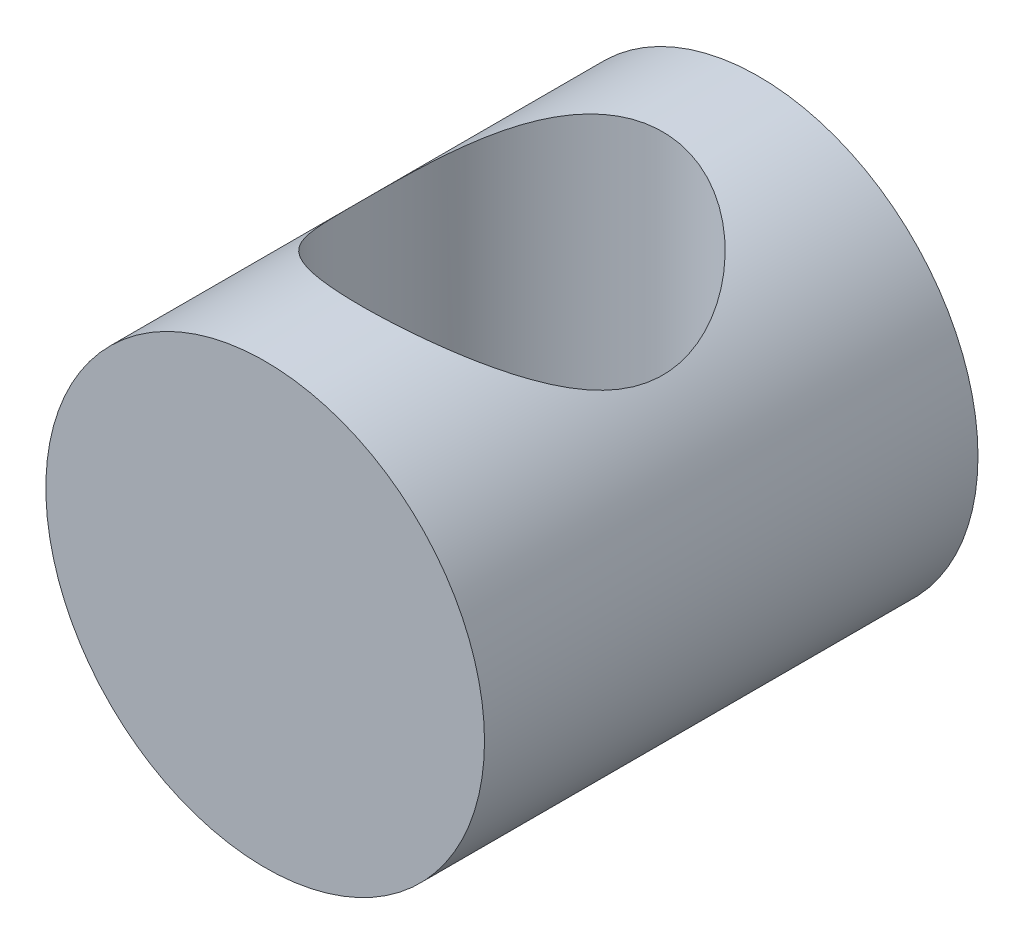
ISO-10303-21;
HEADER;
FILE_DESCRIPTION(('STEP AP214'),'2;1');
FILE_NAME('part.step','',(''),(''),'','','');
FILE_SCHEMA(('AUTOMOTIVE_DESIGN { 1 0 10303 214 1 1 1 1 }'));
ENDSEC;
DATA;
#1=APPLICATION_CONTEXT('core data for automotive mechanical design processes');
#2=APPLICATION_PROTOCOL_DEFINITION('international standard','automotive_design',2000,#1);
#3=PRODUCT_CONTEXT('',#1,'mechanical');
#4=PRODUCT('Part','Part','',(#3));
#5=PRODUCT_RELATED_PRODUCT_CATEGORY('part','',(#4));
#6=PRODUCT_DEFINITION_FORMATION('','',#4);
#7=PRODUCT_DEFINITION_CONTEXT('part definition',#1,'design');
#8=PRODUCT_DEFINITION('design','',#6,#7);
#9=PRODUCT_DEFINITION_SHAPE('','',#8);
#10=(LENGTH_UNIT() NAMED_UNIT(*) SI_UNIT(.MILLI.,.METRE.));
#11=(NAMED_UNIT(*) PLANE_ANGLE_UNIT() SI_UNIT($,.RADIAN.));
#12=(NAMED_UNIT(*) SI_UNIT($,.STERADIAN.) SOLID_ANGLE_UNIT());
#13=UNCERTAINTY_MEASURE_WITH_UNIT(LENGTH_MEASURE(1.E-05),#10,'distance_accuracy_value','');
#14=(GEOMETRIC_REPRESENTATION_CONTEXT(3) GLOBAL_UNCERTAINTY_ASSIGNED_CONTEXT((#13)) GLOBAL_UNIT_ASSIGNED_CONTEXT((#10,
#11,#12)) REPRESENTATION_CONTEXT('',''));
#15=CARTESIAN_POINT('',(0.,0.,0.));
#16=DIRECTION('',(0.,0.,1.));
#17=DIRECTION('',(1.,0.,0.));
#18=AXIS2_PLACEMENT_3D('',#15,#16,#17);
#19=CARTESIAN_POINT('',(0.,0.,18.));
#20=DIRECTION('',(0.,0.,-1.));
#21=DIRECTION('',(-1.,0.,0.));
#22=AXIS2_PLACEMENT_3D('',#19,#20,#21);
#23=CYLINDRICAL_SURFACE('',#22,8.);
#24=CARTESIAN_POINT('',(0.,-8.,14.5));
#25=CARTESIAN_POINT('',(0.137266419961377,-7.99999987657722,14.4999998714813));
#26=CARTESIAN_POINT('',(0.274534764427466,-7.99645958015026,14.4948541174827));
#27=CARTESIAN_POINT('',(0.547943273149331,-7.98238674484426,14.4743541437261));
#28=CARTESIAN_POINT('',(0.684083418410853,-7.97185408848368,14.4589997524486));
#29=CARTESIAN_POINT('',(0.954192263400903,-7.94405156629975,14.4183185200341));
#30=CARTESIAN_POINT('',(1.08816047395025,-7.92678020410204,14.3929894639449));
#31=CARTESIAN_POINT('',(1.35297984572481,-7.88589932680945,14.3327195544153));
#32=CARTESIAN_POINT('',(1.48382964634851,-7.86228709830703,14.2977745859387));
#33=CARTESIAN_POINT('',(1.74083213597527,-7.80939299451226,14.2189528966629));
#34=CARTESIAN_POINT('',(1.86700623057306,-7.7801421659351,14.1751250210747));
#35=CARTESIAN_POINT('',(2.11473737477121,-7.71649352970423,14.0789335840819));
#36=CARTESIAN_POINT('',(2.23629259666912,-7.68209371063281,14.0265666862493));
#37=CARTESIAN_POINT('',(2.59307020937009,-7.57217048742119,13.8574841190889));
#38=CARTESIAN_POINT('',(2.82063002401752,-7.48987513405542,13.7287162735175));
#39=CARTESIAN_POINT('',(3.27066804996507,-7.30527689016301,13.4307937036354));
#40=CARTESIAN_POINT('',(3.49097725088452,-7.201855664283,13.2590981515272));
#41=CARTESIAN_POINT('',(3.90178342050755,-6.98782684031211,12.8862741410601));
#42=CARTESIAN_POINT('',(4.09223553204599,-6.87720877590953,12.685102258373));
#43=CARTESIAN_POINT('',(4.36862185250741,-6.70296528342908,12.3453353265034));
#44=CARTESIAN_POINT('',(4.46513198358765,-6.63888776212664,12.2154145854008));
#45=CARTESIAN_POINT('',(4.64682921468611,-6.51300043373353,11.9467411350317));
#46=CARTESIAN_POINT('',(4.73201351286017,-6.45119119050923,11.8079862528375));
#47=CARTESIAN_POINT('',(4.89030116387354,-6.33204236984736,11.5222164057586));
#48=CARTESIAN_POINT('',(4.96342358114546,-6.27469581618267,11.3752149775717));
#49=CARTESIAN_POINT('',(5.09696884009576,-6.16670701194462,11.0732121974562));
#50=CARTESIAN_POINT('',(5.15739158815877,-6.11606481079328,10.9182107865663));
#51=CARTESIAN_POINT('',(5.28562320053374,-6.00599161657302,10.5383281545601));
#52=CARTESIAN_POINT('',(5.34703685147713,-5.95090176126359,10.3098796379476));
#53=CARTESIAN_POINT('',(5.41693530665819,-5.88708591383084,9.95969894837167));
#54=CARTESIAN_POINT('',(5.43652795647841,-5.86895370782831,9.84176605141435));
#55=CARTESIAN_POINT('',(5.46804253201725,-5.8396048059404,9.6040356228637));
#56=CARTESIAN_POINT('',(5.4799673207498,-5.82838552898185,9.48423880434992));
#57=CARTESIAN_POINT('',(5.49596558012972,-5.81330236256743,9.24301453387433));
#58=CARTESIAN_POINT('',(5.49999675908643,-5.80947809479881,9.12158178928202));
#59=CARTESIAN_POINT('',(5.50000323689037,-5.80947194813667,8.87871571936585));
#60=CARTESIAN_POINT('',(5.49597854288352,-5.81329006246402,8.75728239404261));
#61=CARTESIAN_POINT('',(5.47994768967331,-5.82840411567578,8.5153639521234));
#62=CARTESIAN_POINT('',(5.46793819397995,-5.83970318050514,8.39487925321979));
#63=CARTESIAN_POINT('',(5.43616344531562,-5.86929197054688,8.15578729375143));
#64=CARTESIAN_POINT('',(5.41639493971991,-5.88758462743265,8.03718084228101));
#65=CARTESIAN_POINT('',(5.34864197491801,-5.94942574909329,7.69895690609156));
#66=CARTESIAN_POINT('',(5.29115689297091,-6.00101168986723,7.48263542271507));
#67=CARTESIAN_POINT('',(5.15227529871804,-6.12065172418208,7.06269754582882));
#68=CARTESIAN_POINT('',(5.07086005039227,-6.18871871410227,6.85909125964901));
#69=CARTESIAN_POINT('',(4.90919386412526,-6.31725428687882,6.514743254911));
#70=CARTESIAN_POINT('',(4.83362805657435,-6.37544321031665,6.37090126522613));
#71=CARTESIAN_POINT('',(4.67090265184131,-6.49560554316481,6.09159965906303));
#72=CARTESIAN_POINT('',(4.58374271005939,-6.557579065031,5.95614029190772));
#73=CARTESIAN_POINT('',(4.39819265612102,-6.68344948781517,5.69367568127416));
#74=CARTESIAN_POINT('',(4.29978166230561,-6.74734979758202,5.56668687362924));
#75=CARTESIAN_POINT('',(4.09227177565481,-6.87518444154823,5.32181264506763));
#76=CARTESIAN_POINT('',(3.98317417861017,-6.93911877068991,5.20392612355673));
#77=CARTESIAN_POINT('',(3.75347594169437,-7.06603194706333,4.97659515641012));
#78=CARTESIAN_POINT('',(3.63277138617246,-7.12899489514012,4.8672466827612));
#79=CARTESIAN_POINT('',(3.38116315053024,-7.25171170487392,4.6589866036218));
#80=CARTESIAN_POINT('',(3.25026070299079,-7.3114659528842,4.56007374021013));
#81=CARTESIAN_POINT('',(2.97892919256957,-7.4261455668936,4.37365947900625));
#82=CARTESIAN_POINT('',(2.83851659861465,-7.48107892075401,4.28613908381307));
#83=CARTESIAN_POINT('',(2.54862267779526,-7.584734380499,4.12330668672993));
#84=CARTESIAN_POINT('',(2.3991440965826,-7.63345835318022,4.04799101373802));
#85=CARTESIAN_POINT('',(2.12610532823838,-7.71331232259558,3.92586785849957));
#86=CARTESIAN_POINT('',(2.00414979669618,-7.74594770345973,3.87644239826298));
#87=CARTESIAN_POINT('',(1.75587264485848,-7.80597279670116,3.78613861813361));
#88=CARTESIAN_POINT('',(1.62955197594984,-7.83336364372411,3.74525844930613));
#89=CARTESIAN_POINT('',(1.37329013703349,-7.88232721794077,3.67254238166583));
#90=CARTESIAN_POINT('',(1.24335068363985,-7.90390265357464,3.64070227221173));
#91=CARTESIAN_POINT('',(0.980628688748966,-7.94077833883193,3.58646542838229));
#92=CARTESIAN_POINT('',(0.847846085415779,-7.9560784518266,3.56406889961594));
#93=CARTESIAN_POINT('',(0.579909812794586,-7.98009151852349,3.52898316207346));
#94=CARTESIAN_POINT('',(0.444749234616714,-7.98878011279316,3.51632984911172));
#95=CARTESIAN_POINT('',(0.173593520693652,-7.99926705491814,3.50106334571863));
#96=CARTESIAN_POINT('',(0.0375983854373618,-8.0010654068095,3.49845014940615));
#97=CARTESIAN_POINT('',(-0.23412842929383,-7.99772754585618,3.50330562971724));
#98=CARTESIAN_POINT('',(-0.369860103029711,-7.99259118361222,3.51077452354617));
#99=CARTESIAN_POINT('',(-0.639966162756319,-7.97550985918,3.5356757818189));
#100=CARTESIAN_POINT('',(-0.774340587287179,-7.96356509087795,3.55310786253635));
#101=CARTESIAN_POINT('',(-1.03300361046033,-7.93403118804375,3.59638208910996));
#102=CARTESIAN_POINT('',(-1.15742582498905,-7.91680874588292,3.62167909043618));
#103=CARTESIAN_POINT('',(-1.40342019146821,-7.87692633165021,3.68056097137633));
#104=CARTESIAN_POINT('',(-1.52499135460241,-7.85426450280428,3.71414868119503));
#105=CARTESIAN_POINT('',(-1.88431514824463,-7.77875915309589,3.82677631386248));
#106=CARTESIAN_POINT('',(-2.11688002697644,-7.71837170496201,3.91771526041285));
#107=CARTESIAN_POINT('',(-2.58089638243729,-7.57643923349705,4.13586426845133));
#108=CARTESIAN_POINT('',(-2.81087757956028,-7.4936212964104,4.26533144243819));
#109=CARTESIAN_POINT('',(-3.24680165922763,-7.31531257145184,4.55291914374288));
#110=CARTESIAN_POINT('',(-3.4527272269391,-7.2198127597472,4.71106010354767));
#111=CARTESIAN_POINT('',(-3.87132112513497,-7.00550458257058,5.08161103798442));
#112=CARTESIAN_POINT('',(-4.07924157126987,-6.8854854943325,5.29867588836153));
#113=CARTESIAN_POINT('',(-4.45767290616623,-6.64673868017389,5.76438738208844));
#114=CARTESIAN_POINT('',(-4.62816238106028,-6.52801173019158,6.01305197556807));
#115=CARTESIAN_POINT('',(-4.84380627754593,-6.36744101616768,6.39133987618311));
#116=CARTESIAN_POINT('',(-4.90554891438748,-6.31988980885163,6.5093203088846));
#117=CARTESIAN_POINT('',(-5.02083091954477,-6.22869510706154,6.75074473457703));
#118=CARTESIAN_POINT('',(-5.07436945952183,-6.18505200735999,6.87418927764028));
#119=CARTESIAN_POINT('',(-5.17266294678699,-6.10308564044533,7.12601986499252));
#120=CARTESIAN_POINT('',(-5.2174307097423,-6.06475463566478,7.25439836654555));
#121=CARTESIAN_POINT('',(-5.29769958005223,-5.99476587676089,7.51573553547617));
#122=CARTESIAN_POINT('',(-5.33320654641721,-5.9631039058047,7.64869124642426));
#123=CARTESIAN_POINT('',(-5.38894978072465,-5.9127294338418,7.89448821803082));
#124=CARTESIAN_POINT('',(-5.41077870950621,-5.89271543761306,8.00670265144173));
#125=CARTESIAN_POINT('',(-5.447482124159,-5.85880240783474,8.23313494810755));
#126=CARTESIAN_POINT('',(-5.46235996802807,-5.84490042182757,8.34735181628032));
#127=CARTESIAN_POINT('',(-5.48492486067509,-5.82373081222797,8.57702980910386));
#128=CARTESIAN_POINT('',(-5.49261692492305,-5.81645856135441,8.69249000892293));
#129=CARTESIAN_POINT('',(-5.5006920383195,-5.80882242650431,8.92389815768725));
#130=CARTESIAN_POINT('',(-5.50107496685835,-5.80845865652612,9.03984611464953));
#131=CARTESIAN_POINT('',(-5.49452269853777,-5.8146576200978,9.27133226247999));
#132=CARTESIAN_POINT('',(-5.48758865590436,-5.8212192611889,9.38687051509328));
#133=CARTESIAN_POINT('',(-5.46653306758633,-5.84099396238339,9.61673163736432));
#134=CARTESIAN_POINT('',(-5.45240906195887,-5.85420929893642,9.73105407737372));
#135=CARTESIAN_POINT('',(-5.39954564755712,-5.90316060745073,10.071214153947));
#136=CARTESIAN_POINT('',(-5.35031745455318,-5.94819906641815,10.2941604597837));
#137=CARTESIAN_POINT('',(-5.20736893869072,-6.0741055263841,10.7945509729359));
#138=CARTESIAN_POINT('',(-5.10462333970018,-6.16173174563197,11.0676794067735));
#139=CARTESIAN_POINT('',(-4.92207151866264,-6.30708364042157,11.4584512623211));
#140=CARTESIAN_POINT('',(-4.85639062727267,-6.35791911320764,11.5856896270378));
#141=CARTESIAN_POINT('',(-4.71597898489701,-6.46275715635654,11.8336959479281));
#142=CARTESIAN_POINT('',(-4.64124882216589,-6.51675952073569,11.9544643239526));
#143=CARTESIAN_POINT('',(-4.40061245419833,-6.68379581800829,12.3118378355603));
#144=CARTESIAN_POINT('',(-4.22083124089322,-6.79971419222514,12.5380376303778));
#145=CARTESIAN_POINT('',(-3.92596286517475,-6.97135955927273,12.8545596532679));
#146=CARTESIAN_POINT('',(-3.82342021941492,-7.02822867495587,12.9563128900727));
#147=CARTESIAN_POINT('',(-3.61004986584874,-7.14017005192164,13.1519250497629));
#148=CARTESIAN_POINT('',(-3.49922082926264,-7.19524202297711,13.2457827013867));
#149=CARTESIAN_POINT('',(-3.25261212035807,-7.31038114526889,13.4382955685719));
#150=CARTESIAN_POINT('',(-3.11556524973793,-7.36998432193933,13.5356111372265));
#151=CARTESIAN_POINT('',(-2.83155594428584,-7.48369365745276,13.718131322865));
#152=CARTESIAN_POINT('',(-2.68459805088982,-7.53780230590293,13.8033414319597));
#153=CARTESIAN_POINT('',(-2.38165111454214,-7.63892723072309,13.960526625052));
#154=CARTESIAN_POINT('',(-2.22567242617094,-7.6859514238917,14.0325165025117));
#155=CARTESIAN_POINT('',(-1.90565844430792,-7.77147738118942,14.1621931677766));
#156=CARTESIAN_POINT('',(-1.74162640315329,-7.80998255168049,14.2198856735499));
#157=CARTESIAN_POINT('',(-1.4482825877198,-7.86886427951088,14.3075226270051));
#158=CARTESIAN_POINT('',(-1.32038319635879,-7.89136980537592,14.3408013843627));
#159=CARTESIAN_POINT('',(-1.06164857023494,-7.93032178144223,14.3981894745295));
#160=CARTESIAN_POINT('',(-0.930813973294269,-7.94676953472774,14.4223007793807));
#161=CARTESIAN_POINT('',(-0.667175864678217,-7.97323135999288,14.4610088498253));
#162=CARTESIAN_POINT('',(-0.534373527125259,-7.98324912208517,14.4756110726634));
#163=CARTESIAN_POINT('',(-0.267714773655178,-7.99663367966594,14.4951069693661));
#164=CARTESIAN_POINT('',(-0.133858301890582,-8.00000012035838,14.5000001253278));
#165=CARTESIAN_POINT('',(0.,-8.,14.5));
#166=B_SPLINE_CURVE_WITH_KNOTS('',3,(#24,#25,#26,#27,#28,#29,#30,#31,#32,#33,#34,#35,#36,#37,
#38,#39,#40,#41,#42,#43,#44,#45,#46,#47,#48,#49,#50,#51,#52,#53,#54,#55,#56,#57,#58,#59,#60,#61,
#62,#63,#64,#65,#66,#67,#68,#69,#70,#71,#72,#73,#74,#75,#76,#77,#78,#79,#80,#81,#82,#83,#84,#85,
#86,#87,#88,#89,#90,#91,#92,#93,#94,#95,#96,#97,#98,#99,#100,#101,#102,#103,#104,#105,#106,#107,
#108,#109,#110,#111,#112,#113,#114,#115,#116,#117,#118,#119,#120,#121,#122,#123,#124,#125,#126,
#127,#128,#129,#130,#131,#132,#133,#134,#135,#136,#137,#138,#139,#140,#141,#142,#143,#144,#145,
#146,#147,#148,#149,#150,#151,#152,#153,#154,#155,#156,#157,#158,#159,#160,#161,#162,#163,#164,
#165),.UNSPECIFIED.,.T.,.F.,(4,2,2,2,2,2,2,2,2,2,2,2,2,2,2,2,2,2,2,2,2,2,2,2,2,2,2,2,2,2,2,2,2,
2,2,2,2,2,2,2,2,2,2,2,2,2,2,2,2,2,2,2,2,2,2,2,2,2,2,2,2,2,2,2,2,2,2,2,2,2,4),(0.,
0.411661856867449,0.823330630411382,1.23509086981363,1.64702759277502,2.05675779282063,
2.46664847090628,3.2857146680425,4.17612227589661,5.06785506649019,5.58954551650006,
6.11136478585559,6.6323512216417,7.15334149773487,7.87863512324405,8.24101211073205,
8.60325371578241,8.96743085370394,9.33160766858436,9.69593675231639,10.060418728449,
10.7467806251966,11.4336813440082,11.9508182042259,12.4679704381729,12.986098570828,
13.5041639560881,14.0273986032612,14.5505701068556,15.072857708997,15.5949879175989,
16.0013132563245,16.4075505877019,16.8135983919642,17.2196550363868,17.6272006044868,
18.034745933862,18.442300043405,18.8498425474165,19.2337976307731,19.6178839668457,
20.3854447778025,21.2122255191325,22.0395977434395,23.0068744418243,23.9747030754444,
24.3985827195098,24.8225051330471,25.2458034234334,25.6688332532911,26.0166473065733,
26.3642931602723,26.7116961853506,27.0591049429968,27.4064589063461,27.753931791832,
28.4491268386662,29.3580346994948,29.8135308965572,30.268997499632,31.1989975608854,
31.6644323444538,32.1299419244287,32.6642217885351,33.1982584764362,33.7316938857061,
34.2649156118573,34.6666522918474,35.0683025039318,35.4697220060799,35.8711629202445),.UNSPECIFIED.);
#167=CARTESIAN_POINT('',(0.,-8.,14.5));
#168=VERTEX_POINT('',#167);
#169=EDGE_CURVE('E33',#168,#168,#166,.T.);
#170=ORIENTED_EDGE('',*,*,#169,.T.);
#171=EDGE_LOOP('',(#170));
#172=FACE_BOUND('',#171,.T.);
#173=CARTESIAN_POINT('',(0.,8.,14.5));
#174=CARTESIAN_POINT('',(-0.137266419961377,7.99999987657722,14.4999998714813));
#175=CARTESIAN_POINT('',(-0.274534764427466,7.99645958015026,14.4948541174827));
#176=CARTESIAN_POINT('',(-0.547943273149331,7.98238674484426,14.4743541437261));
#177=CARTESIAN_POINT('',(-0.684083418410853,7.97185408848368,14.4589997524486));
#178=CARTESIAN_POINT('',(-0.954192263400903,7.94405156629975,14.4183185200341));
#179=CARTESIAN_POINT('',(-1.08816047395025,7.92678020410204,14.3929894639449));
#180=CARTESIAN_POINT('',(-1.35297984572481,7.88589932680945,14.3327195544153));
#181=CARTESIAN_POINT('',(-1.48382964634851,7.86228709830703,14.2977745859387));
#182=CARTESIAN_POINT('',(-1.74083213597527,7.80939299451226,14.2189528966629));
#183=CARTESIAN_POINT('',(-1.86700623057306,7.7801421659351,14.1751250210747));
#184=CARTESIAN_POINT('',(-2.11473737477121,7.71649352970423,14.0789335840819));
#185=CARTESIAN_POINT('',(-2.23629259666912,7.68209371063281,14.0265666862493));
#186=CARTESIAN_POINT('',(-2.59307020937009,7.57217048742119,13.8574841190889));
#187=CARTESIAN_POINT('',(-2.82063002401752,7.48987513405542,13.7287162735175));
#188=CARTESIAN_POINT('',(-3.27066804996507,7.30527689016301,13.4307937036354));
#189=CARTESIAN_POINT('',(-3.49097725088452,7.201855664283,13.2590981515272));
#190=CARTESIAN_POINT('',(-3.90178342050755,6.98782684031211,12.8862741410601));
#191=CARTESIAN_POINT('',(-4.09223553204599,6.87720877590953,12.685102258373));
#192=CARTESIAN_POINT('',(-4.36862185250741,6.70296528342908,12.3453353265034));
#193=CARTESIAN_POINT('',(-4.46513198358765,6.63888776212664,12.2154145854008));
#194=CARTESIAN_POINT('',(-4.64682921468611,6.51300043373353,11.9467411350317));
#195=CARTESIAN_POINT('',(-4.73201351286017,6.45119119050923,11.8079862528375));
#196=CARTESIAN_POINT('',(-4.89030116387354,6.33204236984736,11.5222164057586));
#197=CARTESIAN_POINT('',(-4.96342358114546,6.27469581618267,11.3752149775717));
#198=CARTESIAN_POINT('',(-5.09696884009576,6.16670701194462,11.0732121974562));
#199=CARTESIAN_POINT('',(-5.15739158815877,6.11606481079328,10.9182107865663));
#200=CARTESIAN_POINT('',(-5.28562320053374,6.00599161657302,10.5383281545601));
#201=CARTESIAN_POINT('',(-5.34703685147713,5.95090176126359,10.3098796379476));
#202=CARTESIAN_POINT('',(-5.41693530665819,5.88708591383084,9.95969894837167));
#203=CARTESIAN_POINT('',(-5.43652795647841,5.86895370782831,9.84176605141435));
#204=CARTESIAN_POINT('',(-5.46804253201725,5.8396048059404,9.6040356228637));
#205=CARTESIAN_POINT('',(-5.4799673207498,5.82838552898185,9.48423880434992));
#206=CARTESIAN_POINT('',(-5.49596558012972,5.81330236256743,9.24301453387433));
#207=CARTESIAN_POINT('',(-5.49999675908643,5.80947809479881,9.12158178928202));
#208=CARTESIAN_POINT('',(-5.50000323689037,5.80947194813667,8.87871571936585));
#209=CARTESIAN_POINT('',(-5.49597854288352,5.81329006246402,8.75728239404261));
#210=CARTESIAN_POINT('',(-5.47994768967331,5.82840411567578,8.5153639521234));
#211=CARTESIAN_POINT('',(-5.46793819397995,5.83970318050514,8.39487925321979));
#212=CARTESIAN_POINT('',(-5.43616344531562,5.86929197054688,8.15578729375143));
#213=CARTESIAN_POINT('',(-5.41639493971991,5.88758462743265,8.03718084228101));
#214=CARTESIAN_POINT('',(-5.34864197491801,5.94942574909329,7.69895690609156));
#215=CARTESIAN_POINT('',(-5.29115689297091,6.00101168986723,7.48263542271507));
#216=CARTESIAN_POINT('',(-5.15227529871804,6.12065172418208,7.06269754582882));
#217=CARTESIAN_POINT('',(-5.07086005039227,6.18871871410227,6.85909125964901));
#218=CARTESIAN_POINT('',(-4.90919386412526,6.31725428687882,6.514743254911));
#219=CARTESIAN_POINT('',(-4.83362805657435,6.37544321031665,6.37090126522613));
#220=CARTESIAN_POINT('',(-4.67090265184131,6.49560554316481,6.09159965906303));
#221=CARTESIAN_POINT('',(-4.58374271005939,6.557579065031,5.95614029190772));
#222=CARTESIAN_POINT('',(-4.39819265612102,6.68344948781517,5.69367568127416));
#223=CARTESIAN_POINT('',(-4.29978166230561,6.74734979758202,5.56668687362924));
#224=CARTESIAN_POINT('',(-4.09227177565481,6.87518444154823,5.32181264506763));
#225=CARTESIAN_POINT('',(-3.98317417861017,6.93911877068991,5.20392612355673));
#226=CARTESIAN_POINT('',(-3.75347594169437,7.06603194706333,4.97659515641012));
#227=CARTESIAN_POINT('',(-3.63277138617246,7.12899489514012,4.8672466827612));
#228=CARTESIAN_POINT('',(-3.38116315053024,7.25171170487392,4.6589866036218));
#229=CARTESIAN_POINT('',(-3.25026070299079,7.3114659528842,4.56007374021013));
#230=CARTESIAN_POINT('',(-2.97892919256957,7.4261455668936,4.37365947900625));
#231=CARTESIAN_POINT('',(-2.83851659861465,7.48107892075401,4.28613908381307));
#232=CARTESIAN_POINT('',(-2.54862267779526,7.584734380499,4.12330668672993));
#233=CARTESIAN_POINT('',(-2.3991440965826,7.63345835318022,4.04799101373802));
#234=CARTESIAN_POINT('',(-2.12610532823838,7.71331232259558,3.92586785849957));
#235=CARTESIAN_POINT('',(-2.00414979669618,7.74594770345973,3.87644239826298));
#236=CARTESIAN_POINT('',(-1.75587264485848,7.80597279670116,3.78613861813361));
#237=CARTESIAN_POINT('',(-1.62955197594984,7.83336364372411,3.74525844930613));
#238=CARTESIAN_POINT('',(-1.37329013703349,7.88232721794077,3.67254238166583));
#239=CARTESIAN_POINT('',(-1.24335068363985,7.90390265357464,3.64070227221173));
#240=CARTESIAN_POINT('',(-0.980628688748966,7.94077833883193,3.58646542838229));
#241=CARTESIAN_POINT('',(-0.847846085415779,7.9560784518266,3.56406889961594));
#242=CARTESIAN_POINT('',(-0.579909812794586,7.98009151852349,3.52898316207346));
#243=CARTESIAN_POINT('',(-0.444749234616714,7.98878011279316,3.51632984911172));
#244=CARTESIAN_POINT('',(-0.173593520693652,7.99926705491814,3.50106334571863));
#245=CARTESIAN_POINT('',(-0.0375983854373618,8.0010654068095,3.49845014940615));
#246=CARTESIAN_POINT('',(0.23412842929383,7.99772754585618,3.50330562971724));
#247=CARTESIAN_POINT('',(0.369860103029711,7.99259118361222,3.51077452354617));
#248=CARTESIAN_POINT('',(0.639966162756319,7.97550985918,3.5356757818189));
#249=CARTESIAN_POINT('',(0.774340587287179,7.96356509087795,3.55310786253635));
#250=CARTESIAN_POINT('',(1.03300361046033,7.93403118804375,3.59638208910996));
#251=CARTESIAN_POINT('',(1.15742582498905,7.91680874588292,3.62167909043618));
#252=CARTESIAN_POINT('',(1.40342019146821,7.87692633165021,3.68056097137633));
#253=CARTESIAN_POINT('',(1.52499135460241,7.85426450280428,3.71414868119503));
#254=CARTESIAN_POINT('',(1.88431514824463,7.77875915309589,3.82677631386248));
#255=CARTESIAN_POINT('',(2.11688002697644,7.71837170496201,3.91771526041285));
#256=CARTESIAN_POINT('',(2.58089638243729,7.57643923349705,4.13586426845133));
#257=CARTESIAN_POINT('',(2.81087757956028,7.4936212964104,4.26533144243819));
#258=CARTESIAN_POINT('',(3.24680165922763,7.31531257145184,4.55291914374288));
#259=CARTESIAN_POINT('',(3.4527272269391,7.2198127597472,4.71106010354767));
#260=CARTESIAN_POINT('',(3.87132112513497,7.00550458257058,5.08161103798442));
#261=CARTESIAN_POINT('',(4.07924157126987,6.8854854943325,5.29867588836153));
#262=CARTESIAN_POINT('',(4.45767290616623,6.64673868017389,5.76438738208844));
#263=CARTESIAN_POINT('',(4.62816238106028,6.52801173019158,6.01305197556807));
#264=CARTESIAN_POINT('',(4.84380627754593,6.36744101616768,6.39133987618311));
#265=CARTESIAN_POINT('',(4.90554891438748,6.31988980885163,6.5093203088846));
#266=CARTESIAN_POINT('',(5.02083091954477,6.22869510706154,6.75074473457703));
#267=CARTESIAN_POINT('',(5.07436945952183,6.18505200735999,6.87418927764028));
#268=CARTESIAN_POINT('',(5.17266294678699,6.10308564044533,7.12601986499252));
#269=CARTESIAN_POINT('',(5.2174307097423,6.06475463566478,7.25439836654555));
#270=CARTESIAN_POINT('',(5.29769958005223,5.99476587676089,7.51573553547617));
#271=CARTESIAN_POINT('',(5.33320654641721,5.9631039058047,7.64869124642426));
#272=CARTESIAN_POINT('',(5.38894978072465,5.9127294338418,7.89448821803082));
#273=CARTESIAN_POINT('',(5.41077870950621,5.89271543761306,8.00670265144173));
#274=CARTESIAN_POINT('',(5.447482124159,5.85880240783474,8.23313494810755));
#275=CARTESIAN_POINT('',(5.46235996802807,5.84490042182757,8.34735181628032));
#276=CARTESIAN_POINT('',(5.48492486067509,5.82373081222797,8.57702980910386));
#277=CARTESIAN_POINT('',(5.49261692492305,5.81645856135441,8.69249000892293));
#278=CARTESIAN_POINT('',(5.5006920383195,5.80882242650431,8.92389815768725));
#279=CARTESIAN_POINT('',(5.50107496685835,5.80845865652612,9.03984611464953));
#280=CARTESIAN_POINT('',(5.49452269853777,5.8146576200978,9.27133226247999));
#281=CARTESIAN_POINT('',(5.48758865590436,5.8212192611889,9.38687051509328));
#282=CARTESIAN_POINT('',(5.46653306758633,5.84099396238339,9.61673163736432));
#283=CARTESIAN_POINT('',(5.45240906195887,5.85420929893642,9.73105407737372));
#284=CARTESIAN_POINT('',(5.39954564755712,5.90316060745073,10.071214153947));
#285=CARTESIAN_POINT('',(5.35031745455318,5.94819906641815,10.2941604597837));
#286=CARTESIAN_POINT('',(5.20736893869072,6.0741055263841,10.7945509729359));
#287=CARTESIAN_POINT('',(5.10462333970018,6.16173174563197,11.0676794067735));
#288=CARTESIAN_POINT('',(4.92207151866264,6.30708364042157,11.4584512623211));
#289=CARTESIAN_POINT('',(4.85639062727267,6.35791911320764,11.5856896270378));
#290=CARTESIAN_POINT('',(4.71597898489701,6.46275715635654,11.8336959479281));
#291=CARTESIAN_POINT('',(4.64124882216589,6.51675952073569,11.9544643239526));
#292=CARTESIAN_POINT('',(4.40061245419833,6.68379581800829,12.3118378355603));
#293=CARTESIAN_POINT('',(4.22083124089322,6.79971419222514,12.5380376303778));
#294=CARTESIAN_POINT('',(3.92596286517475,6.97135955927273,12.8545596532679));
#295=CARTESIAN_POINT('',(3.82342021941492,7.02822867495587,12.9563128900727));
#296=CARTESIAN_POINT('',(3.61004986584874,7.14017005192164,13.1519250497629));
#297=CARTESIAN_POINT('',(3.49922082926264,7.19524202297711,13.2457827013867));
#298=CARTESIAN_POINT('',(3.25261212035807,7.31038114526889,13.4382955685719));
#299=CARTESIAN_POINT('',(3.11556524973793,7.36998432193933,13.5356111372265));
#300=CARTESIAN_POINT('',(2.83155594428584,7.48369365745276,13.718131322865));
#301=CARTESIAN_POINT('',(2.68459805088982,7.53780230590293,13.8033414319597));
#302=CARTESIAN_POINT('',(2.38165111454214,7.63892723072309,13.960526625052));
#303=CARTESIAN_POINT('',(2.22567242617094,7.6859514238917,14.0325165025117));
#304=CARTESIAN_POINT('',(1.90565844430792,7.77147738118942,14.1621931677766));
#305=CARTESIAN_POINT('',(1.74162640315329,7.80998255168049,14.2198856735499));
#306=CARTESIAN_POINT('',(1.4482825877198,7.86886427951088,14.3075226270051));
#307=CARTESIAN_POINT('',(1.32038319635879,7.89136980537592,14.3408013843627));
#308=CARTESIAN_POINT('',(1.06164857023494,7.93032178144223,14.3981894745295));
#309=CARTESIAN_POINT('',(0.930813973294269,7.94676953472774,14.4223007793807));
#310=CARTESIAN_POINT('',(0.667175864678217,7.97323135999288,14.4610088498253));
#311=CARTESIAN_POINT('',(0.534373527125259,7.98324912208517,14.4756110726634));
#312=CARTESIAN_POINT('',(0.267714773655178,7.99663367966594,14.4951069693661));
#313=CARTESIAN_POINT('',(0.133858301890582,8.00000012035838,14.5000001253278));
#314=CARTESIAN_POINT('',(0.,8.,14.5));
#315=B_SPLINE_CURVE_WITH_KNOTS('',3,(#173,#174,#175,#176,#177,#178,#179,#180,#181,#182,#183,
#184,#185,#186,#187,#188,#189,#190,#191,#192,#193,#194,#195,#196,#197,#198,#199,#200,#201,#202,
#203,#204,#205,#206,#207,#208,#209,#210,#211,#212,#213,#214,#215,#216,#217,#218,#219,#220,#221,
#222,#223,#224,#225,#226,#227,#228,#229,#230,#231,#232,#233,#234,#235,#236,#237,#238,#239,#240,
#241,#242,#243,#244,#245,#246,#247,#248,#249,#250,#251,#252,#253,#254,#255,#256,#257,#258,#259,
#260,#261,#262,#263,#264,#265,#266,#267,#268,#269,#270,#271,#272,#273,#274,#275,#276,#277,#278,
#279,#280,#281,#282,#283,#284,#285,#286,#287,#288,#289,#290,#291,#292,#293,#294,#295,#296,#297,
#298,#299,#300,#301,#302,#303,#304,#305,#306,#307,#308,#309,#310,#311,#312,#313,#314),
.UNSPECIFIED.,.T.,.F.,(4,2,2,2,2,2,2,2,2,2,2,2,2,2,2,2,2,2,2,2,2,2,2,2,2,2,2,2,2,2,2,2,2,2,2,2,
2,2,2,2,2,2,2,2,2,2,2,2,2,2,2,2,2,2,2,2,2,2,2,2,2,2,2,2,2,2,2,2,2,2,4),(0.,0.411661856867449,
0.823330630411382,1.23509086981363,1.64702759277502,2.05675779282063,2.46664847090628,
3.2857146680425,4.17612227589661,5.06785506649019,5.58954551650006,6.11136478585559,
6.6323512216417,7.15334149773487,7.87863512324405,8.24101211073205,8.60325371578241,
8.96743085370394,9.33160766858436,9.69593675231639,10.060418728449,10.7467806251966,
11.4336813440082,11.9508182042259,12.4679704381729,12.986098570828,13.5041639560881,
14.0273986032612,14.5505701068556,15.072857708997,15.5949879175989,16.0013132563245,
16.4075505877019,16.8135983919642,17.2196550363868,17.6272006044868,18.034745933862,
18.442300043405,18.8498425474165,19.2337976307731,19.6178839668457,20.3854447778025,
21.2122255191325,22.0395977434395,23.0068744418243,23.9747030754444,24.3985827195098,
24.8225051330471,25.2458034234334,25.6688332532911,26.0166473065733,26.3642931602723,
26.7116961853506,27.0591049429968,27.4064589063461,27.753931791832,28.4491268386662,
29.3580346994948,29.8135308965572,30.268997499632,31.1989975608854,31.6644323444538,
32.1299419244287,32.6642217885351,33.1982584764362,33.7316938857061,34.2649156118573,
34.6666522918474,35.0683025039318,35.4697220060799,35.8711629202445),.UNSPECIFIED.);
#316=CARTESIAN_POINT('',(0.,8.,14.5));
#317=VERTEX_POINT('',#316);
#318=EDGE_CURVE('E46',#317,#317,#315,.T.);
#319=ORIENTED_EDGE('',*,*,#318,.T.);
#320=EDGE_LOOP('',(#319));
#321=FACE_BOUND('',#320,.T.);
#322=CARTESIAN_POINT('',(0.,0.,18.));
#323=DIRECTION('',(0.,0.,1.));
#324=DIRECTION('',(1.,0.,0.));
#325=AXIS2_PLACEMENT_3D('',#322,#323,#324);
#326=CIRCLE('',#325,8.);
#327=CARTESIAN_POINT('',(8.,0.,18.));
#328=VERTEX_POINT('',#327);
#329=EDGE_CURVE('E10',#328,#328,#326,.T.);
#330=ORIENTED_EDGE('',*,*,#329,.F.);
#331=EDGE_LOOP('',(#330));
#332=FACE_BOUND('',#331,.T.);
#333=CARTESIAN_POINT('',(0.,0.,0.));
#334=DIRECTION('',(0.,0.,1.));
#335=DIRECTION('',(1.,0.,0.));
#336=AXIS2_PLACEMENT_3D('',#333,#334,#335);
#337=CIRCLE('',#336,8.);
#338=CARTESIAN_POINT('',(8.,0.,0.));
#339=VERTEX_POINT('',#338);
#340=EDGE_CURVE('E40',#339,#339,#337,.T.);
#341=ORIENTED_EDGE('',*,*,#340,.T.);
#342=EDGE_LOOP('',(#341));
#343=FACE_BOUND('',#342,.T.);
#344=ADVANCED_FACE('F29',(#172,#321,#332,#343),#23,.T.);
#345=CARTESIAN_POINT('',(0.,0.,18.));
#346=DIRECTION('',(0.,0.,1.));
#347=DIRECTION('',(1.,0.,0.));
#348=AXIS2_PLACEMENT_3D('',#345,#346,#347);
#349=PLANE('',#348);
#350=ORIENTED_EDGE('',*,*,#329,.T.);
#351=EDGE_LOOP('',(#350));
#352=FACE_BOUND('',#351,.T.);
#353=ADVANCED_FACE('F56',(#352),#349,.T.);
#354=CARTESIAN_POINT('',(0.,0.,0.));
#355=DIRECTION('',(0.,0.,1.));
#356=DIRECTION('',(1.,0.,0.));
#357=AXIS2_PLACEMENT_3D('',#354,#355,#356);
#358=PLANE('',#357);
#359=ORIENTED_EDGE('',*,*,#340,.F.);
#360=EDGE_LOOP('',(#359));
#361=FACE_BOUND('',#360,.T.);
#362=ADVANCED_FACE('F54',(#361),#358,.F.);
#363=CARTESIAN_POINT('',(0.,-10.,9.));
#364=DIRECTION('',(0.,1.,0.));
#365=DIRECTION('',(0.,0.,1.));
#366=AXIS2_PLACEMENT_3D('',#363,#364,#365);
#367=CYLINDRICAL_SURFACE('',#366,5.5);
#368=ORIENTED_EDGE('',*,*,#318,.F.);
#369=EDGE_LOOP('',(#368));
#370=FACE_BOUND('',#369,.T.);
#371=ORIENTED_EDGE('',*,*,#169,.F.);
#372=EDGE_LOOP('',(#371));
#373=FACE_BOUND('',#372,.T.);
#374=ADVANCED_FACE('F50',(#370,#373),#367,.F.);
#375=CLOSED_SHELL('',(#344,#353,#362,#374));
#376=MANIFOLD_SOLID_BREP('B2',#375);
#377=ADVANCED_BREP_SHAPE_REPRESENTATION('',(#18,#376),#14);
#378=SHAPE_DEFINITION_REPRESENTATION(#9,#377);
ENDSEC;
END-ISO-10303-21;
